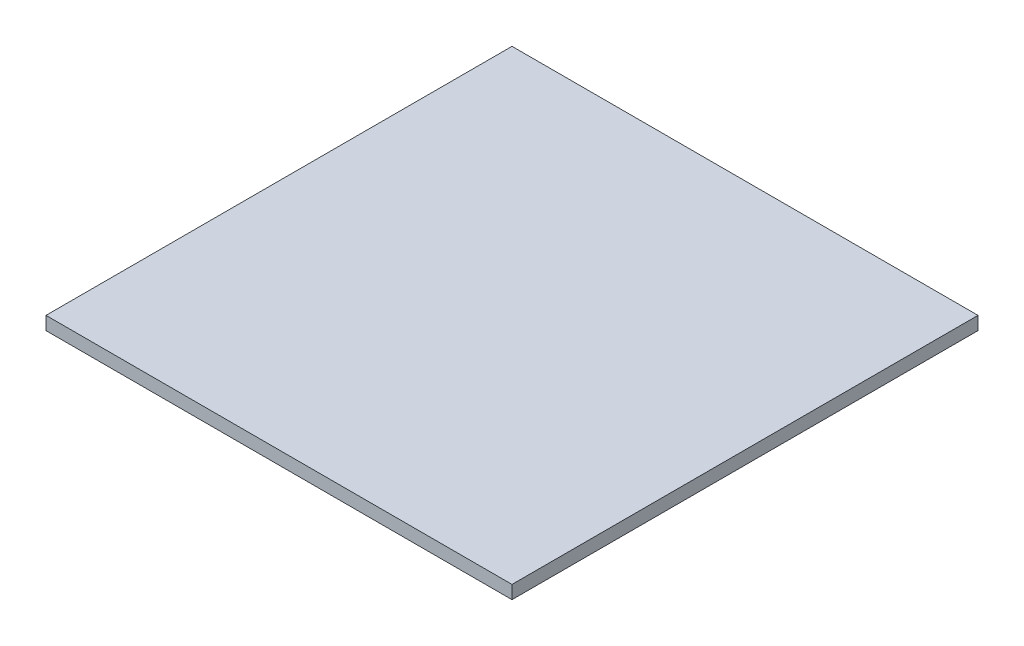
ISO-10303-21;
HEADER;
FILE_DESCRIPTION(('STEP AP214'),'2;1');
FILE_NAME('part.step','',(''),(''),'','','');
FILE_SCHEMA(('AUTOMOTIVE_DESIGN { 1 0 10303 214 1 1 1 1 }'));
ENDSEC;
DATA;
#1=APPLICATION_CONTEXT('core data for automotive mechanical design processes');
#2=APPLICATION_PROTOCOL_DEFINITION('international standard','automotive_design',2000,#1);
#3=PRODUCT_CONTEXT('',#1,'mechanical');
#4=PRODUCT('Part','Part','',(#3));
#5=PRODUCT_RELATED_PRODUCT_CATEGORY('part','',(#4));
#6=PRODUCT_DEFINITION_FORMATION('','',#4);
#7=PRODUCT_DEFINITION_CONTEXT('part definition',#1,'design');
#8=PRODUCT_DEFINITION('design','',#6,#7);
#9=PRODUCT_DEFINITION_SHAPE('','',#8);
#10=(LENGTH_UNIT() NAMED_UNIT(*) SI_UNIT(.MILLI.,.METRE.));
#11=(NAMED_UNIT(*) PLANE_ANGLE_UNIT() SI_UNIT($,.RADIAN.));
#12=(NAMED_UNIT(*) SI_UNIT($,.STERADIAN.) SOLID_ANGLE_UNIT());
#13=UNCERTAINTY_MEASURE_WITH_UNIT(LENGTH_MEASURE(1.E-05),#10,'distance_accuracy_value','');
#14=(GEOMETRIC_REPRESENTATION_CONTEXT(3) GLOBAL_UNCERTAINTY_ASSIGNED_CONTEXT((#13)) GLOBAL_UNIT_ASSIGNED_CONTEXT((#10,
#11,#12)) REPRESENTATION_CONTEXT('',''));
#15=CARTESIAN_POINT('',(0.,0.,0.));
#16=DIRECTION('',(0.,0.,1.));
#17=DIRECTION('',(1.,0.,0.));
#18=AXIS2_PLACEMENT_3D('',#15,#16,#17);
#19=CARTESIAN_POINT('',(-88.,5.,-88.));
#20=DIRECTION('',(0.,0.,1.));
#21=DIRECTION('',(1.,0.,0.));
#22=AXIS2_PLACEMENT_3D('',#19,#20,#21);
#23=PLANE('',#22);
#24=DIRECTION('',(0.,1.,0.));
#25=VECTOR('',#24,1.);
#26=CARTESIAN_POINT('',(-11.3578143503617,5.,-88.));
#27=LINE('',#26,#25);
#28=CARTESIAN_POINT('',(-11.3578143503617,0.,-88.));
#29=VERTEX_POINT('',#28);
#30=CARTESIAN_POINT('',(-11.3578143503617,5.,-88.));
#31=VERTEX_POINT('',#30);
#32=EDGE_CURVE('E12',#29,#31,#27,.T.);
#33=ORIENTED_EDGE('',*,*,#32,.F.);
#34=DIRECTION('',(-1.,0.,0.));
#35=VECTOR('',#34,1.);
#36=CARTESIAN_POINT('',(-88.,0.,-88.));
#37=LINE('',#36,#35);
#38=CARTESIAN_POINT('',(-88.,0.,-88.));
#39=VERTEX_POINT('',#38);
#40=EDGE_CURVE('E158',#29,#39,#37,.T.);
#41=ORIENTED_EDGE('',*,*,#40,.T.);
#42=DIRECTION('',(0.,-1.,0.));
#43=VECTOR('',#42,1.);
#44=CARTESIAN_POINT('',(-88.,5.,-88.));
#45=LINE('',#44,#43);
#46=CARTESIAN_POINT('',(-88.,5.,-88.));
#47=VERTEX_POINT('',#46);
#48=EDGE_CURVE('E126',#47,#39,#45,.T.);
#49=ORIENTED_EDGE('',*,*,#48,.F.);
#50=DIRECTION('',(-1.,0.,0.));
#51=VECTOR('',#50,1.);
#52=CARTESIAN_POINT('',(-88.,5.,-88.));
#53=LINE('',#52,#51);
#54=EDGE_CURVE('E111',#31,#47,#53,.T.);
#55=ORIENTED_EDGE('',*,*,#54,.F.);
#56=EDGE_LOOP('',(#33,#41,#49,#55));
#57=FACE_BOUND('',#56,.T.);
#58=ADVANCED_FACE('F48',(#57),#23,.F.);
#59=DIRECTION('',(0.,-1.,0.));
#60=VECTOR('',#59,1.);
#61=CARTESIAN_POINT('',(7.75272558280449,5.,-88.));
#62=LINE('',#61,#60);
#63=CARTESIAN_POINT('',(7.75272558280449,5.,-88.));
#64=VERTEX_POINT('',#63);
#65=CARTESIAN_POINT('',(7.75272558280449,0.,-88.));
#66=VERTEX_POINT('',#65);
#67=EDGE_CURVE('E58',#64,#66,#62,.T.);
#68=ORIENTED_EDGE('',*,*,#67,.F.);
#69=CARTESIAN_POINT('',(88.,5.,-88.));
#70=VERTEX_POINT('',#69);
#71=EDGE_CURVE('E99',#70,#64,#53,.T.);
#72=ORIENTED_EDGE('',*,*,#71,.F.);
#73=DIRECTION('',(0.,-1.,0.));
#74=VECTOR('',#73,1.);
#75=CARTESIAN_POINT('',(88.,5.,-88.));
#76=LINE('',#75,#74);
#77=CARTESIAN_POINT('',(88.,0.,-88.));
#78=VERTEX_POINT('',#77);
#79=EDGE_CURVE('E103',#70,#78,#76,.T.);
#80=ORIENTED_EDGE('',*,*,#79,.T.);
#81=EDGE_CURVE('E159',#78,#66,#37,.T.);
#82=ORIENTED_EDGE('',*,*,#81,.T.);
#83=EDGE_LOOP('',(#68,#72,#80,#82));
#84=FACE_BOUND('',#83,.T.);
#85=ADVANCED_FACE('F101',(#84),#23,.F.);
#86=CARTESIAN_POINT('',(88.,5.,-88.));
#87=DIRECTION('',(-1.,0.,0.));
#88=DIRECTION('',(0.,0.,1.));
#89=AXIS2_PLACEMENT_3D('',#86,#87,#88);
#90=PLANE('',#89);
#91=DIRECTION('',(0.,0.,-1.));
#92=VECTOR('',#91,1.);
#93=CARTESIAN_POINT('',(88.,0.,-88.));
#94=LINE('',#93,#92);
#95=CARTESIAN_POINT('',(88.,0.,88.));
#96=VERTEX_POINT('',#95);
#97=EDGE_CURVE('E124',#96,#78,#94,.T.);
#98=ORIENTED_EDGE('',*,*,#97,.T.);
#99=ORIENTED_EDGE('',*,*,#79,.F.);
#100=DIRECTION('',(0.,0.,-1.));
#101=VECTOR('',#100,1.);
#102=CARTESIAN_POINT('',(88.,5.,-88.));
#103=LINE('',#102,#101);
#104=CARTESIAN_POINT('',(88.,5.,88.));
#105=VERTEX_POINT('',#104);
#106=EDGE_CURVE('E113',#105,#70,#103,.T.);
#107=ORIENTED_EDGE('',*,*,#106,.F.);
#108=DIRECTION('',(0.,-1.,0.));
#109=VECTOR('',#108,1.);
#110=CARTESIAN_POINT('',(88.,5.,88.));
#111=LINE('',#110,#109);
#112=EDGE_CURVE('E137',#105,#96,#111,.T.);
#113=ORIENTED_EDGE('',*,*,#112,.T.);
#114=EDGE_LOOP('',(#98,#99,#107,#113));
#115=FACE_BOUND('',#114,.T.);
#116=ADVANCED_FACE('F50',(#115),#90,.F.);
#117=EDGE_CURVE('E162',#66,#29,#37,.T.);
#118=ORIENTED_EDGE('',*,*,#117,.T.);
#119=ORIENTED_EDGE('',*,*,#32,.T.);
#120=EDGE_CURVE('E109',#64,#31,#53,.T.);
#121=ORIENTED_EDGE('',*,*,#120,.F.);
#122=ORIENTED_EDGE('',*,*,#67,.T.);
#123=EDGE_LOOP('',(#118,#119,#121,#122));
#124=FACE_BOUND('',#123,.T.);
#125=ADVANCED_FACE('F188',(#124),#23,.F.);
#126=CARTESIAN_POINT('',(-88.,5.,-88.));
#127=DIRECTION('',(1.,0.,0.));
#128=DIRECTION('',(0.,0.,-1.));
#129=AXIS2_PLACEMENT_3D('',#126,#127,#128);
#130=PLANE('',#129);
#131=DIRECTION('',(0.,0.,1.));
#132=VECTOR('',#131,1.);
#133=CARTESIAN_POINT('',(-88.,0.,-88.));
#134=LINE('',#133,#132);
#135=CARTESIAN_POINT('',(-88.,0.,88.));
#136=VERTEX_POINT('',#135);
#137=EDGE_CURVE('E143',#39,#136,#134,.T.);
#138=ORIENTED_EDGE('',*,*,#137,.T.);
#139=DIRECTION('',(0.,-1.,0.));
#140=VECTOR('',#139,1.);
#141=CARTESIAN_POINT('',(-88.,5.,88.));
#142=LINE('',#141,#140);
#143=CARTESIAN_POINT('',(-88.,5.,88.));
#144=VERTEX_POINT('',#143);
#145=EDGE_CURVE('E131',#144,#136,#142,.T.);
#146=ORIENTED_EDGE('',*,*,#145,.F.);
#147=DIRECTION('',(0.,0.,1.));
#148=VECTOR('',#147,1.);
#149=CARTESIAN_POINT('',(-88.,5.,-88.));
#150=LINE('',#149,#148);
#151=EDGE_CURVE('E108',#47,#144,#150,.T.);
#152=ORIENTED_EDGE('',*,*,#151,.F.);
#153=ORIENTED_EDGE('',*,*,#48,.T.);
#154=EDGE_LOOP('',(#138,#146,#152,#153));
#155=FACE_BOUND('',#154,.T.);
#156=ADVANCED_FACE('F175',(#155),#130,.F.);
#157=CARTESIAN_POINT('',(-88.,5.,88.));
#158=DIRECTION('',(0.,0.,-1.));
#159=DIRECTION('',(-1.,0.,0.));
#160=AXIS2_PLACEMENT_3D('',#157,#158,#159);
#161=PLANE('',#160);
#162=DIRECTION('',(1.,0.,0.));
#163=VECTOR('',#162,1.);
#164=CARTESIAN_POINT('',(-88.,0.,88.));
#165=LINE('',#164,#163);
#166=EDGE_CURVE('E121',#136,#96,#165,.T.);
#167=ORIENTED_EDGE('',*,*,#166,.T.);
#168=ORIENTED_EDGE('',*,*,#112,.F.);
#169=DIRECTION('',(1.,0.,0.));
#170=VECTOR('',#169,1.);
#171=CARTESIAN_POINT('',(-88.,5.,88.));
#172=LINE('',#171,#170);
#173=EDGE_CURVE('E116',#144,#105,#172,.T.);
#174=ORIENTED_EDGE('',*,*,#173,.F.);
#175=ORIENTED_EDGE('',*,*,#145,.T.);
#176=EDGE_LOOP('',(#167,#168,#174,#175));
#177=FACE_BOUND('',#176,.T.);
#178=ADVANCED_FACE('F180',(#177),#161,.F.);
#179=CARTESIAN_POINT('',(0.,5.,0.));
#180=DIRECTION('',(0.,1.,0.));
#181=DIRECTION('',(0.,0.,1.));
#182=AXIS2_PLACEMENT_3D('',#179,#180,#181);
#183=PLANE('',#182);
#184=ORIENTED_EDGE('',*,*,#106,.T.);
#185=ORIENTED_EDGE('',*,*,#71,.T.);
#186=ORIENTED_EDGE('',*,*,#120,.T.);
#187=ORIENTED_EDGE('',*,*,#54,.T.);
#188=ORIENTED_EDGE('',*,*,#151,.T.);
#189=ORIENTED_EDGE('',*,*,#173,.T.);
#190=EDGE_LOOP('',(#184,#185,#186,#187,#188,#189));
#191=FACE_BOUND('',#190,.T.);
#192=ADVANCED_FACE('F114',(#191),#183,.T.);
#193=CARTESIAN_POINT('',(0.,0.,0.));
#194=DIRECTION('',(0.,1.,0.));
#195=DIRECTION('',(0.,0.,1.));
#196=AXIS2_PLACEMENT_3D('',#193,#194,#195);
#197=PLANE('',#196);
#198=ORIENTED_EDGE('',*,*,#97,.F.);
#199=ORIENTED_EDGE('',*,*,#166,.F.);
#200=ORIENTED_EDGE('',*,*,#137,.F.);
#201=ORIENTED_EDGE('',*,*,#40,.F.);
#202=ORIENTED_EDGE('',*,*,#117,.F.);
#203=ORIENTED_EDGE('',*,*,#81,.F.);
#204=EDGE_LOOP('',(#198,#199,#200,#201,#202,#203));
#205=FACE_BOUND('',#204,.T.);
#206=ADVANCED_FACE('F178',(#205),#197,.F.);
#207=CLOSED_SHELL('',(#58,#85,#116,#125,#156,#178,#192,#206));
#208=MANIFOLD_SOLID_BREP('B2',#207);
#209=ADVANCED_BREP_SHAPE_REPRESENTATION('',(#18,#208),#14);
#210=SHAPE_DEFINITION_REPRESENTATION(#9,#209);
ENDSEC;
END-ISO-10303-21;
